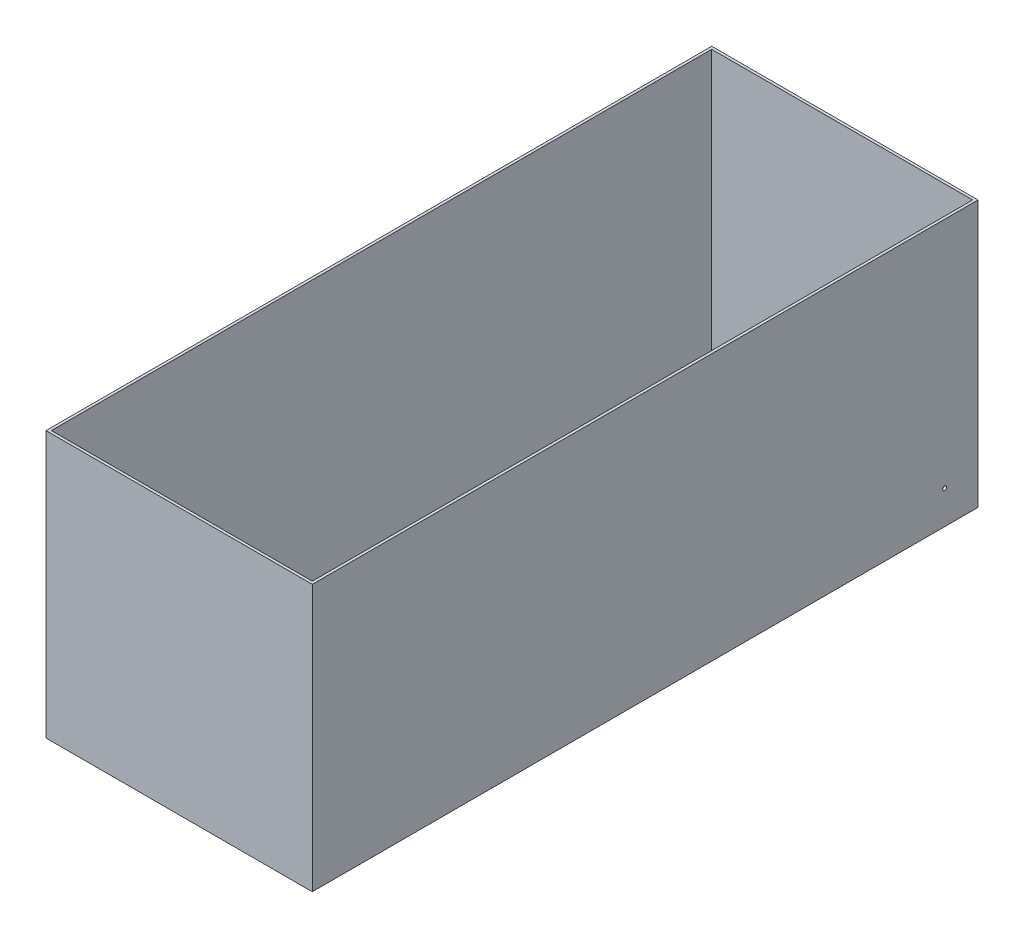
from build123d import *

# Parameters (mm, degrees)
CROQUIS1_W              = 200
CROQUIS1_H              = 500
SALIENTE_EXTRUIR1_DEPTH = 200
VACIADO1_T              = -2
CROQUIS2_R              = 1.5
CORTAR_EXTRUIR1_DEPTH   = 43
CROQUIS3_R              = 1.5
CORTAR_EXTRUIR2_DEPTH   = 43


with BuildPart() as part:
    # Croquis1 → Saliente-Extruir1 (new body)
    with BuildSketch(Plane(origin=(0, 0, 0), x_dir=(1, 0, 0), z_dir=(0, 1, 0))):
        Rectangle(CROQUIS1_W, CROQUIS1_H)
    extrude(amount=SALIENTE_EXTRUIR1_DEPTH)

    # Vaciado1
    vaciado1_openings = [part.faces().sort_by_distance(p)[0] for p in [
        (0, 200, 0),
    ]]
    offset(amount=VACIADO1_T, openings=vaciado1_openings, kind=Kind.INTERSECTION)

    # Croquis2 → Cortar-Extruir1 (cut)
    with BuildSketch(Plane(origin=(100, 0, 0), x_dir=(0, 0, -1), z_dir=(1, 0, 0))):
        with Locations((225, 25)):
            Circle(CROQUIS2_R)
    extrude(amount=-CORTAR_EXTRUIR1_DEPTH, mode=Mode.SUBTRACT)

    # Croquis3 → Cortar-Extruir2 (cut)
    with BuildSketch(Plane.ZY.offset(100)):
        with Locations((225, 175)):
            Circle(CROQUIS3_R)
    extrude(amount=-CORTAR_EXTRUIR2_DEPTH, mode=Mode.SUBTRACT)


solid = part.part
